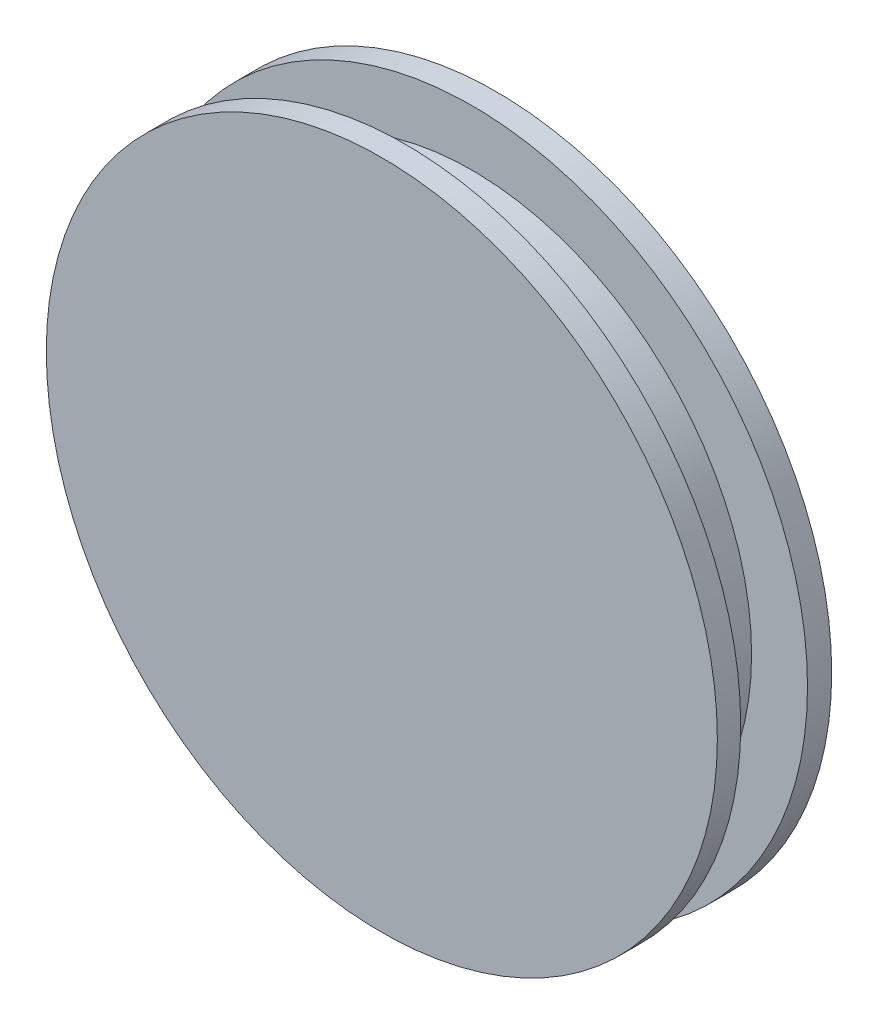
ISO-10303-21;
HEADER;
FILE_DESCRIPTION(('STEP AP214'),'2;1');
FILE_NAME('part.step','',(''),(''),'','','');
FILE_SCHEMA(('AUTOMOTIVE_DESIGN { 1 0 10303 214 1 1 1 1 }'));
ENDSEC;
DATA;
#1=APPLICATION_CONTEXT('core data for automotive mechanical design processes');
#2=APPLICATION_PROTOCOL_DEFINITION('international standard','automotive_design',2000,#1);
#3=PRODUCT_CONTEXT('',#1,'mechanical');
#4=PRODUCT('Part','Part','',(#3));
#5=PRODUCT_RELATED_PRODUCT_CATEGORY('part','',(#4));
#6=PRODUCT_DEFINITION_FORMATION('','',#4);
#7=PRODUCT_DEFINITION_CONTEXT('part definition',#1,'design');
#8=PRODUCT_DEFINITION('design','',#6,#7);
#9=PRODUCT_DEFINITION_SHAPE('','',#8);
#10=(LENGTH_UNIT() NAMED_UNIT(*) SI_UNIT(.MILLI.,.METRE.));
#11=(NAMED_UNIT(*) PLANE_ANGLE_UNIT() SI_UNIT($,.RADIAN.));
#12=(NAMED_UNIT(*) SI_UNIT($,.STERADIAN.) SOLID_ANGLE_UNIT());
#13=UNCERTAINTY_MEASURE_WITH_UNIT(LENGTH_MEASURE(1.E-05),#10,'distance_accuracy_value','');
#14=(GEOMETRIC_REPRESENTATION_CONTEXT(3) GLOBAL_UNCERTAINTY_ASSIGNED_CONTEXT((#13)) GLOBAL_UNIT_ASSIGNED_CONTEXT((#10,
#11,#12)) REPRESENTATION_CONTEXT('',''));
#15=CARTESIAN_POINT('',(0.,0.,0.));
#16=DIRECTION('',(0.,0.,1.));
#17=DIRECTION('',(1.,0.,0.));
#18=AXIS2_PLACEMENT_3D('',#15,#16,#17);
#19=CARTESIAN_POINT('',(0.,0.,3.4798));
#20=DIRECTION('',(0.,0.,-1.));
#21=DIRECTION('',(-1.,0.,0.));
#22=AXIS2_PLACEMENT_3D('',#19,#20,#21);
#23=CYLINDRICAL_SURFACE('',#22,10.2108);
#24=CARTESIAN_POINT('',(0.,0.,2.7686));
#25=DIRECTION('',(0.,0.,1.));
#26=DIRECTION('',(1.,0.,0.));
#27=AXIS2_PLACEMENT_3D('',#24,#25,#26);
#28=CIRCLE('',#27,10.2108);
#29=CARTESIAN_POINT('',(10.2108,0.,2.7686));
#30=VERTEX_POINT('',#29);
#31=EDGE_CURVE('E37',#30,#30,#28,.T.);
#32=ORIENTED_EDGE('',*,*,#31,.T.);
#33=EDGE_LOOP('',(#32));
#34=FACE_BOUND('',#33,.T.);
#35=CARTESIAN_POINT('',(0.,0.,3.4798));
#36=DIRECTION('',(0.,0.,1.));
#37=DIRECTION('',(1.,0.,0.));
#38=AXIS2_PLACEMENT_3D('',#35,#36,#37);
#39=CIRCLE('',#38,10.2108);
#40=CARTESIAN_POINT('',(10.2108,0.,3.4798));
#41=VERTEX_POINT('',#40);
#42=EDGE_CURVE('E11',#41,#41,#39,.T.);
#43=ORIENTED_EDGE('',*,*,#42,.F.);
#44=EDGE_LOOP('',(#43));
#45=FACE_BOUND('',#44,.T.);
#46=ADVANCED_FACE('F34',(#34,#45),#23,.T.);
#47=CARTESIAN_POINT('',(0.,0.,3.4798));
#48=DIRECTION('',(0.,0.,1.));
#49=DIRECTION('',(1.,0.,0.));
#50=AXIS2_PLACEMENT_3D('',#47,#48,#49);
#51=PLANE('',#50);
#52=ORIENTED_EDGE('',*,*,#42,.T.);
#53=EDGE_LOOP('',(#52));
#54=FACE_BOUND('',#53,.T.);
#55=ADVANCED_FACE('F75',(#54),#51,.T.);
#56=CARTESIAN_POINT('',(0.,0.,2.7686));
#57=DIRECTION('',(0.,0.,1.));
#58=DIRECTION('',(1.,0.,0.));
#59=AXIS2_PLACEMENT_3D('',#56,#57,#58);
#60=PLANE('',#59);
#61=CARTESIAN_POINT('',(0.,0.,2.7686));
#62=DIRECTION('',(0.,0.,1.));
#63=DIRECTION('',(1.,0.,0.));
#64=AXIS2_PLACEMENT_3D('',#61,#62,#63);
#65=CIRCLE('',#64,8.509);
#66=CARTESIAN_POINT('',(8.509,0.,2.7686));
#67=VERTEX_POINT('',#66);
#68=EDGE_CURVE('E52',#67,#67,#65,.T.);
#69=ORIENTED_EDGE('',*,*,#68,.T.);
#70=EDGE_LOOP('',(#69));
#71=FACE_BOUND('',#70,.T.);
#72=ORIENTED_EDGE('',*,*,#31,.F.);
#73=EDGE_LOOP('',(#72));
#74=FACE_BOUND('',#73,.T.);
#75=ADVANCED_FACE('F66',(#71,#74),#60,.F.);
#76=CARTESIAN_POINT('',(0.,0.,0.7366));
#77=DIRECTION('',(0.,0.,1.));
#78=DIRECTION('',(1.,0.,0.));
#79=AXIS2_PLACEMENT_3D('',#76,#77,#78);
#80=PLANE('',#79);
#81=CARTESIAN_POINT('',(0.,0.,0.7366));
#82=DIRECTION('',(0.,0.,1.));
#83=DIRECTION('',(1.,0.,0.));
#84=AXIS2_PLACEMENT_3D('',#81,#82,#83);
#85=CIRCLE('',#84,8.509);
#86=CARTESIAN_POINT('',(8.509,0.,0.7366));
#87=VERTEX_POINT('',#86);
#88=EDGE_CURVE('E48',#87,#87,#85,.T.);
#89=ORIENTED_EDGE('',*,*,#88,.F.);
#90=EDGE_LOOP('',(#89));
#91=FACE_BOUND('',#90,.T.);
#92=CARTESIAN_POINT('',(0.,0.,0.7366));
#93=DIRECTION('',(0.,0.,1.));
#94=DIRECTION('',(1.,0.,0.));
#95=AXIS2_PLACEMENT_3D('',#92,#93,#94);
#96=CIRCLE('',#95,10.2108);
#97=CARTESIAN_POINT('',(10.2108,0.,0.7366));
#98=VERTEX_POINT('',#97);
#99=EDGE_CURVE('E50',#98,#98,#96,.T.);
#100=ORIENTED_EDGE('',*,*,#99,.T.);
#101=EDGE_LOOP('',(#100));
#102=FACE_BOUND('',#101,.T.);
#103=ADVANCED_FACE('F64',(#91,#102),#80,.T.);
#104=CARTESIAN_POINT('',(0.,0.,2.7686));
#105=DIRECTION('',(0.,0.,-1.));
#106=DIRECTION('',(-1.,0.,0.));
#107=AXIS2_PLACEMENT_3D('',#104,#105,#106);
#108=CYLINDRICAL_SURFACE('',#107,8.509);
#109=ORIENTED_EDGE('',*,*,#68,.F.);
#110=EDGE_LOOP('',(#109));
#111=FACE_BOUND('',#110,.T.);
#112=ORIENTED_EDGE('',*,*,#88,.T.);
#113=EDGE_LOOP('',(#112));
#114=FACE_BOUND('',#113,.T.);
#115=ADVANCED_FACE('F62',(#111,#114),#108,.T.);
#116=CARTESIAN_POINT('',(0.,0.,0.));
#117=DIRECTION('',(0.,0.,1.));
#118=DIRECTION('',(1.,0.,0.));
#119=AXIS2_PLACEMENT_3D('',#116,#117,#118);
#120=PLANE('',#119);
#121=CARTESIAN_POINT('',(0.,0.,0.));
#122=DIRECTION('',(0.,0.,1.));
#123=DIRECTION('',(1.,0.,0.));
#124=AXIS2_PLACEMENT_3D('',#121,#122,#123);
#125=CIRCLE('',#124,10.2108);
#126=CARTESIAN_POINT('',(10.2108,0.,0.));
#127=VERTEX_POINT('',#126);
#128=EDGE_CURVE('E41',#127,#127,#125,.T.);
#129=ORIENTED_EDGE('',*,*,#128,.F.);
#130=EDGE_LOOP('',(#129));
#131=FACE_BOUND('',#130,.T.);
#132=ADVANCED_FACE('F72',(#131),#120,.F.);
#133=ORIENTED_EDGE('',*,*,#128,.T.);
#134=EDGE_LOOP('',(#133));
#135=FACE_BOUND('',#134,.T.);
#136=ORIENTED_EDGE('',*,*,#99,.F.);
#137=EDGE_LOOP('',(#136));
#138=FACE_BOUND('',#137,.T.);
#139=ADVANCED_FACE('F80',(#135,#138),#23,.T.);
#140=CLOSED_SHELL('',(#46,#55,#75,#103,#115,#132,#139));
#141=MANIFOLD_SOLID_BREP('B2',#140);
#142=ADVANCED_BREP_SHAPE_REPRESENTATION('',(#18,#141),#14);
#143=SHAPE_DEFINITION_REPRESENTATION(#9,#142);
ENDSEC;
END-ISO-10303-21;
